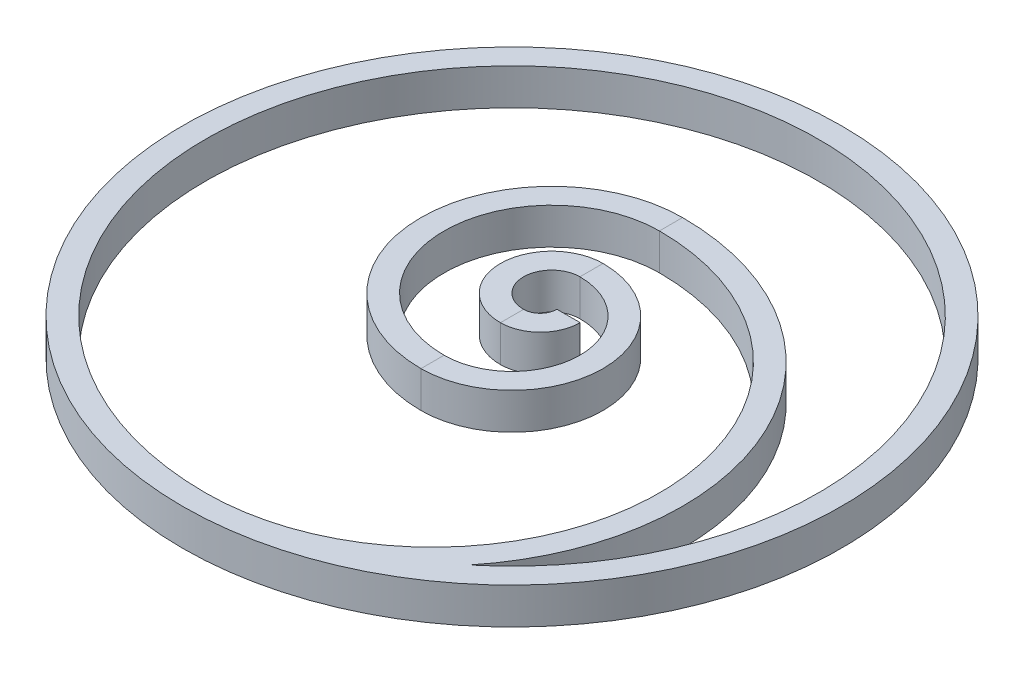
ISO-10303-21;
HEADER;
FILE_DESCRIPTION(('STEP AP214'),'2;1');
FILE_NAME('part.step','',(''),(''),'','','');
FILE_SCHEMA(('AUTOMOTIVE_DESIGN { 1 0 10303 214 1 1 1 1 }'));
ENDSEC;
DATA;
#1=APPLICATION_CONTEXT('core data for automotive mechanical design processes');
#2=APPLICATION_PROTOCOL_DEFINITION('international standard','automotive_design',2000,#1);
#3=PRODUCT_CONTEXT('',#1,'mechanical');
#4=PRODUCT('Part','Part','',(#3));
#5=PRODUCT_RELATED_PRODUCT_CATEGORY('part','',(#4));
#6=PRODUCT_DEFINITION_FORMATION('','',#4);
#7=PRODUCT_DEFINITION_CONTEXT('part definition',#1,'design');
#8=PRODUCT_DEFINITION('design','',#6,#7);
#9=PRODUCT_DEFINITION_SHAPE('','',#8);
#10=(LENGTH_UNIT() NAMED_UNIT(*) SI_UNIT(.MILLI.,.METRE.));
#11=(NAMED_UNIT(*) PLANE_ANGLE_UNIT() SI_UNIT($,.RADIAN.));
#12=(NAMED_UNIT(*) SI_UNIT($,.STERADIAN.) SOLID_ANGLE_UNIT());
#13=UNCERTAINTY_MEASURE_WITH_UNIT(LENGTH_MEASURE(1.E-05),#10,'distance_accuracy_value','');
#14=(GEOMETRIC_REPRESENTATION_CONTEXT(3) GLOBAL_UNCERTAINTY_ASSIGNED_CONTEXT((#13)) GLOBAL_UNIT_ASSIGNED_CONTEXT((#10,
#11,#12)) REPRESENTATION_CONTEXT('',''));
#15=CARTESIAN_POINT('',(0.,0.,0.));
#16=DIRECTION('',(0.,0.,1.));
#17=DIRECTION('',(1.,0.,0.));
#18=AXIS2_PLACEMENT_3D('',#15,#16,#17);
#19=CARTESIAN_POINT('',(-30.3271902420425,0.,-3.04623481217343));
#20=DIRECTION('',(0.00405620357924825,0.,0.999991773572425));
#21=DIRECTION('',(0.999991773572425,0.,-0.00405620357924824));
#22=AXIS2_PLACEMENT_3D('',#19,#20,#21);
#23=PLANE('',#22);
#24=DIRECTION('',(0.,1.,0.));
#25=VECTOR('',#24,1.);
#26=CARTESIAN_POINT('',(3.39980503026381,-2.00000000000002,-3.18303949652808));
#27=LINE('',#26,#25);
#28=CARTESIAN_POINT('',(3.39980503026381,-2.00000000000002,-3.18303949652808));
#29=VERTEX_POINT('',#28);
#30=CARTESIAN_POINT('',(3.39980503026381,1.99999999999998,-3.18303949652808));
#31=VERTEX_POINT('',#30);
#32=EDGE_CURVE('E259',#29,#31,#27,.T.);
#33=ORIENTED_EDGE('',*,*,#32,.T.);
#34=DIRECTION('',(0.999991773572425,0.,-0.00405620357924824));
#35=VECTOR('',#34,1.);
#36=CARTESIAN_POINT('',(5.9452386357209,1.99999999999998,-3.19336437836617));
#37=LINE('',#36,#35);
#38=CARTESIAN_POINT('',(5.94523863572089,1.99999999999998,-3.19336437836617));
#39=VERTEX_POINT('',#38);
#40=EDGE_CURVE('E246',#31,#39,#37,.T.);
#41=ORIENTED_EDGE('',*,*,#40,.T.);
#42=DIRECTION('',(0.,-1.,0.));
#43=VECTOR('',#42,1.);
#44=CARTESIAN_POINT('',(5.9452386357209,-2.00000000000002,-3.19336437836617));
#45=LINE('',#44,#43);
#46=CARTESIAN_POINT('',(5.94523863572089,-2.00000000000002,-3.19336437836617));
#47=VERTEX_POINT('',#46);
#48=EDGE_CURVE('E245',#39,#47,#45,.T.);
#49=ORIENTED_EDGE('',*,*,#48,.T.);
#50=DIRECTION('',(-0.999991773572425,0.,0.00405620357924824));
#51=VECTOR('',#50,1.);
#52=CARTESIAN_POINT('',(5.9452386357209,-2.00000000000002,-3.19336437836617));
#53=LINE('',#52,#51);
#54=EDGE_CURVE('E11',#47,#29,#53,.T.);
#55=ORIENTED_EDGE('',*,*,#54,.T.);
#56=EDGE_LOOP('',(#33,#41,#49,#55));
#57=FACE_BOUND('',#56,.T.);
#58=ADVANCED_FACE('F38',(#57),#23,.F.);
#59=CARTESIAN_POINT('',(1.56508992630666,0.,8.6818600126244));
#60=DIRECTION('',(0.,1.,0.));
#61=DIRECTION('',(0.,0.,1.));
#62=AXIS2_PLACEMENT_3D('',#59,#60,#61);
#63=CYLINDRICAL_SURFACE('',#62,24.9772727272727);
#64=CARTESIAN_POINT('',(1.56508992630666,1.99999999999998,8.6818600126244));
#65=DIRECTION('',(0.,1.,0.));
#66=DIRECTION('',(0.,0.,1.));
#67=AXIS2_PLACEMENT_3D('',#64,#65,#66);
#68=CIRCLE('',#67,24.9772727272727);
#69=CARTESIAN_POINT('',(1.56508992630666,1.99999999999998,33.6591327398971));
#70=VERTEX_POINT('',#69);
#71=CARTESIAN_POINT('',(1.56508992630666,1.99999999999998,-16.2954127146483));
#72=VERTEX_POINT('',#71);
#73=EDGE_CURVE('E169',#70,#72,#68,.T.);
#74=ORIENTED_EDGE('',*,*,#73,.T.);
#75=DIRECTION('',(0.,1.,0.));
#76=VECTOR('',#75,1.);
#77=CARTESIAN_POINT('',(1.56508992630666,-2.00000000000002,-16.2954127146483));
#78=LINE('',#77,#76);
#79=CARTESIAN_POINT('',(1.56508992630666,-2.00000000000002,-16.2954127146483));
#80=VERTEX_POINT('',#79);
#81=EDGE_CURVE('E172',#80,#72,#78,.T.);
#82=ORIENTED_EDGE('',*,*,#81,.F.);
#83=CARTESIAN_POINT('',(1.56508992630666,-2.00000000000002,8.6818600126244));
#84=DIRECTION('',(0.,1.,0.));
#85=DIRECTION('',(0.,0.,1.));
#86=AXIS2_PLACEMENT_3D('',#83,#84,#85);
#87=CIRCLE('',#86,24.9772727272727);
#88=CARTESIAN_POINT('',(1.56508992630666,-2.00000000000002,33.6591327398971));
#89=VERTEX_POINT('',#88);
#90=EDGE_CURVE('E295',#89,#80,#87,.T.);
#91=ORIENTED_EDGE('',*,*,#90,.F.);
#92=DIRECTION('',(0.,1.,0.));
#93=VECTOR('',#92,1.);
#94=CARTESIAN_POINT('',(1.56508992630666,-2.00000000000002,33.6591327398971));
#95=LINE('',#94,#93);
#96=EDGE_CURVE('E178',#89,#70,#95,.T.);
#97=ORIENTED_EDGE('',*,*,#96,.T.);
#98=EDGE_LOOP('',(#74,#82,#91,#97));
#99=FACE_BOUND('',#98,.T.);
#100=ADVANCED_FACE('F317',(#99),#63,.F.);
#101=CARTESIAN_POINT('',(1.56508992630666,1.99999999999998,36.2045872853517));
#102=DIRECTION('',(0.,1.,0.));
#103=DIRECTION('',(0.,0.,1.));
#104=AXIS2_PLACEMENT_3D('',#101,#102,#103);
#105=PLANE('',#104);
#106=CARTESIAN_POINT('',(1.56508992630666,1.99999999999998,-0.0681399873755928));
#107=DIRECTION('',(0.,1.,0.));
#108=DIRECTION('',(0.,0.,1.));
#109=AXIS2_PLACEMENT_3D('',#106,#107,#108);
#110=CIRCLE('',#109,36.2727272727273);
#111=CARTESIAN_POINT('',(1.56508992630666,1.99999999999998,36.2045872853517));
#112=VERTEX_POINT('',#111);
#113=EDGE_CURVE('E194',#112,#112,#110,.T.);
#114=ORIENTED_EDGE('',*,*,#113,.T.);
#115=EDGE_LOOP('',(#114));
#116=FACE_BOUND('',#115,.T.);
#117=ORIENTED_EDGE('',*,*,#73,.F.);
#118=CARTESIAN_POINT('',(1.56508992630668,1.99999999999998,-0.0681399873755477));
#119=DIRECTION('',(0.,1.,0.));
#120=DIRECTION('',(0.,0.,1.));
#121=AXIS2_PLACEMENT_3D('',#118,#119,#120);
#122=CIRCLE('',#121,33.7272727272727);
#123=CARTESIAN_POINT('',(22.9378152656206,1.99999999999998,26.0227691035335));
#124=VERTEX_POINT('',#123);
#125=EDGE_CURVE('E140',#124,#70,#122,.T.);
#126=ORIENTED_EDGE('',*,*,#125,.F.);
#127=CARTESIAN_POINT('',(1.56508992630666,1.99999999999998,8.68186001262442));
#128=DIRECTION('',(0.,1.,0.));
#129=DIRECTION('',(0.,0.,1.));
#130=AXIS2_PLACEMENT_3D('',#127,#128,#129);
#131=CIRCLE('',#130,27.5227272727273);
#132=CARTESIAN_POINT('',(1.56508992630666,1.99999999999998,-18.8408672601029));
#133=VERTEX_POINT('',#132);
#134=EDGE_CURVE('E132',#124,#133,#131,.T.);
#135=ORIENTED_EDGE('',*,*,#134,.T.);
#136=DIRECTION('',(0.,0.,-1.));
#137=VECTOR('',#136,1.);
#138=CARTESIAN_POINT('',(1.56508992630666,1.99999999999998,-18.8408672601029));
#139=LINE('',#138,#137);
#140=EDGE_CURVE('E137',#72,#133,#139,.T.);
#141=ORIENTED_EDGE('',*,*,#140,.F.);
#142=EDGE_LOOP('',(#117,#126,#135,#141));
#143=FACE_BOUND('',#142,.T.);
#144=ADVANCED_FACE('F135',(#116,#143),#105,.T.);
#145=CARTESIAN_POINT('',(1.56508992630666,0.,8.68186001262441));
#146=DIRECTION('',(0.,1.,0.));
#147=DIRECTION('',(0.,0.,1.));
#148=AXIS2_PLACEMENT_3D('',#145,#146,#147);
#149=CYLINDRICAL_SURFACE('',#148,27.5227272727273);
#150=DIRECTION('',(0.,1.,0.));
#151=VECTOR('',#150,1.);
#152=CARTESIAN_POINT('',(22.9378152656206,0.,26.0227691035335));
#153=LINE('',#152,#151);
#154=CARTESIAN_POINT('',(22.9378152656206,-2.00000000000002,26.0227691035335));
#155=VERTEX_POINT('',#154);
#156=EDGE_CURVE('E58',#155,#124,#153,.T.);
#157=ORIENTED_EDGE('',*,*,#156,.F.);
#158=CARTESIAN_POINT('',(1.56508992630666,-2.00000000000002,8.68186001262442));
#159=DIRECTION('',(0.,1.,0.));
#160=DIRECTION('',(0.,0.,1.));
#161=AXIS2_PLACEMENT_3D('',#158,#159,#160);
#162=CIRCLE('',#161,27.5227272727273);
#163=CARTESIAN_POINT('',(1.56508992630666,-2.00000000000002,-18.8408672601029));
#164=VERTEX_POINT('',#163);
#165=EDGE_CURVE('E161',#155,#164,#162,.T.);
#166=ORIENTED_EDGE('',*,*,#165,.T.);
#167=DIRECTION('',(0.,-1.,0.));
#168=VECTOR('',#167,1.);
#169=CARTESIAN_POINT('',(1.56508992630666,-2.00000000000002,-18.8408672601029));
#170=LINE('',#169,#168);
#171=EDGE_CURVE('E143',#133,#164,#170,.T.);
#172=ORIENTED_EDGE('',*,*,#171,.F.);
#173=ORIENTED_EDGE('',*,*,#134,.F.);
#174=EDGE_LOOP('',(#157,#166,#172,#173));
#175=FACE_BOUND('',#174,.T.);
#176=ADVANCED_FACE('F160',(#175),#149,.T.);
#177=CARTESIAN_POINT('',(1.56508992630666,-2.00000000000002,36.2045872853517));
#178=DIRECTION('',(0.,-1.,0.));
#179=DIRECTION('',(0.,0.,-1.));
#180=AXIS2_PLACEMENT_3D('',#177,#178,#179);
#181=PLANE('',#180);
#182=CARTESIAN_POINT('',(1.56508992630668,-2.00000000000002,-0.0681399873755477));
#183=DIRECTION('',(0.,1.,0.));
#184=DIRECTION('',(0.,0.,1.));
#185=AXIS2_PLACEMENT_3D('',#182,#183,#184);
#186=CIRCLE('',#185,33.7272727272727);
#187=EDGE_CURVE('E183',#155,#89,#186,.T.);
#188=ORIENTED_EDGE('',*,*,#187,.T.);
#189=ORIENTED_EDGE('',*,*,#90,.T.);
#190=DIRECTION('',(0.,0.,1.));
#191=VECTOR('',#190,1.);
#192=CARTESIAN_POINT('',(1.56508992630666,-2.00000000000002,-18.8408672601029));
#193=LINE('',#192,#191);
#194=EDGE_CURVE('E181',#164,#80,#193,.T.);
#195=ORIENTED_EDGE('',*,*,#194,.F.);
#196=ORIENTED_EDGE('',*,*,#165,.F.);
#197=EDGE_LOOP('',(#188,#189,#195,#196));
#198=FACE_BOUND('',#197,.T.);
#199=CARTESIAN_POINT('',(1.56508992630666,-2.00000000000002,-0.0681399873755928));
#200=DIRECTION('',(0.,1.,0.));
#201=DIRECTION('',(0.,0.,1.));
#202=AXIS2_PLACEMENT_3D('',#199,#200,#201);
#203=CIRCLE('',#202,36.2727272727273);
#204=CARTESIAN_POINT('',(1.56508992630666,-2.00000000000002,36.2045872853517));
#205=VERTEX_POINT('',#204);
#206=EDGE_CURVE('E179',#205,#205,#203,.T.);
#207=ORIENTED_EDGE('',*,*,#206,.F.);
#208=EDGE_LOOP('',(#207));
#209=FACE_BOUND('',#208,.T.);
#210=ADVANCED_FACE('F309',(#198,#209),#181,.T.);
#211=CARTESIAN_POINT('',(1.56508992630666,0.,-4.44313998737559));
#212=DIRECTION('',(0.,1.,0.));
#213=DIRECTION('',(0.,0.,1.));
#214=AXIS2_PLACEMENT_3D('',#211,#212,#213);
#215=CYLINDRICAL_SURFACE('',#214,11.8522727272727);
#216=CARTESIAN_POINT('',(1.56508992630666,1.99999999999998,-4.44313998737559));
#217=DIRECTION('',(0.,1.,0.));
#218=DIRECTION('',(0.,0.,1.));
#219=AXIS2_PLACEMENT_3D('',#216,#217,#218);
#220=CIRCLE('',#219,11.8522727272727);
#221=CARTESIAN_POINT('',(1.56508992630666,1.99999999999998,7.40913273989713));
#222=VERTEX_POINT('',#221);
#223=EDGE_CURVE('E167',#72,#222,#220,.T.);
#224=ORIENTED_EDGE('',*,*,#223,.T.);
#225=DIRECTION('',(0.,1.,0.));
#226=VECTOR('',#225,1.);
#227=CARTESIAN_POINT('',(1.56508992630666,-2.00000000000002,7.40913273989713));
#228=LINE('',#227,#226);
#229=CARTESIAN_POINT('',(1.56508992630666,-2.00000000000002,7.40913273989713));
#230=VERTEX_POINT('',#229);
#231=EDGE_CURVE('E284',#230,#222,#228,.T.);
#232=ORIENTED_EDGE('',*,*,#231,.F.);
#233=CARTESIAN_POINT('',(1.56508992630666,-2.00000000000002,-4.44313998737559));
#234=DIRECTION('',(0.,1.,0.));
#235=DIRECTION('',(0.,0.,1.));
#236=AXIS2_PLACEMENT_3D('',#233,#234,#235);
#237=CIRCLE('',#236,11.8522727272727);
#238=EDGE_CURVE('E190',#80,#230,#237,.T.);
#239=ORIENTED_EDGE('',*,*,#238,.F.);
#240=ORIENTED_EDGE('',*,*,#81,.T.);
#241=EDGE_LOOP('',(#224,#232,#239,#240));
#242=FACE_BOUND('',#241,.T.);
#243=ADVANCED_FACE('F319',(#242),#215,.F.);
#244=CARTESIAN_POINT('',(1.56508992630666,1.99999999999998,-18.8408672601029));
#245=DIRECTION('',(0.,1.,0.));
#246=DIRECTION('',(0.,0.,1.));
#247=AXIS2_PLACEMENT_3D('',#244,#245,#246);
#248=PLANE('',#247);
#249=CARTESIAN_POINT('',(1.56508992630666,1.99999999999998,-4.44313998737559));
#250=DIRECTION('',(0.,1.,0.));
#251=DIRECTION('',(0.,0.,1.));
#252=AXIS2_PLACEMENT_3D('',#249,#250,#251);
#253=CIRCLE('',#252,14.3977272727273);
#254=CARTESIAN_POINT('',(1.56508992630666,1.99999999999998,9.95458728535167));
#255=VERTEX_POINT('',#254);
#256=EDGE_CURVE('E149',#133,#255,#253,.T.);
#257=ORIENTED_EDGE('',*,*,#256,.T.);
#258=DIRECTION('',(0.,0.,1.));
#259=VECTOR('',#258,1.);
#260=CARTESIAN_POINT('',(1.56508992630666,1.99999999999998,9.95458728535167));
#261=LINE('',#260,#259);
#262=EDGE_CURVE('E158',#222,#255,#261,.T.);
#263=ORIENTED_EDGE('',*,*,#262,.F.);
#264=ORIENTED_EDGE('',*,*,#223,.F.);
#265=ORIENTED_EDGE('',*,*,#140,.T.);
#266=EDGE_LOOP('',(#257,#263,#264,#265));
#267=FACE_BOUND('',#266,.T.);
#268=ADVANCED_FACE('F165',(#267),#248,.T.);
#269=CARTESIAN_POINT('',(1.56508992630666,0.,-4.44313998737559));
#270=DIRECTION('',(0.,1.,0.));
#271=DIRECTION('',(0.,0.,1.));
#272=AXIS2_PLACEMENT_3D('',#269,#270,#271);
#273=CYLINDRICAL_SURFACE('',#272,14.3977272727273);
#274=CARTESIAN_POINT('',(1.56508992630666,-2.00000000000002,-4.44313998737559));
#275=DIRECTION('',(0.,1.,0.));
#276=DIRECTION('',(0.,0.,1.));
#277=AXIS2_PLACEMENT_3D('',#274,#275,#276);
#278=CIRCLE('',#277,14.3977272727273);
#279=CARTESIAN_POINT('',(1.56508992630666,-2.00000000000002,9.95458728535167));
#280=VERTEX_POINT('',#279);
#281=EDGE_CURVE('E195',#164,#280,#278,.T.);
#282=ORIENTED_EDGE('',*,*,#281,.T.);
#283=DIRECTION('',(0.,-1.,0.));
#284=VECTOR('',#283,1.);
#285=CARTESIAN_POINT('',(1.56508992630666,-2.00000000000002,9.95458728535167));
#286=LINE('',#285,#284);
#287=EDGE_CURVE('E153',#255,#280,#286,.T.);
#288=ORIENTED_EDGE('',*,*,#287,.F.);
#289=ORIENTED_EDGE('',*,*,#256,.F.);
#290=ORIENTED_EDGE('',*,*,#171,.T.);
#291=EDGE_LOOP('',(#282,#288,#289,#290));
#292=FACE_BOUND('',#291,.T.);
#293=ADVANCED_FACE('F151',(#292),#273,.T.);
#294=CARTESIAN_POINT('',(1.56508992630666,-2.00000000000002,-18.8408672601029));
#295=DIRECTION('',(0.,-1.,0.));
#296=DIRECTION('',(0.,0.,-1.));
#297=AXIS2_PLACEMENT_3D('',#294,#295,#296);
#298=PLANE('',#297);
#299=DIRECTION('',(0.,0.,-1.));
#300=VECTOR('',#299,1.);
#301=CARTESIAN_POINT('',(1.56508992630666,-2.00000000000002,9.95458728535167));
#302=LINE('',#301,#300);
#303=EDGE_CURVE('E198',#280,#230,#302,.T.);
#304=ORIENTED_EDGE('',*,*,#303,.F.);
#305=ORIENTED_EDGE('',*,*,#281,.F.);
#306=ORIENTED_EDGE('',*,*,#194,.T.);
#307=ORIENTED_EDGE('',*,*,#238,.T.);
#308=EDGE_LOOP('',(#304,#305,#306,#307));
#309=FACE_BOUND('',#308,.T.);
#310=ADVANCED_FACE('F315',(#309),#298,.T.);
#311=CARTESIAN_POINT('',(1.56508992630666,0.,-0.0681399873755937));
#312=DIRECTION('',(0.,1.,0.));
#313=DIRECTION('',(0.,0.,1.));
#314=AXIS2_PLACEMENT_3D('',#311,#312,#313);
#315=CYLINDRICAL_SURFACE('',#314,7.47727272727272);
#316=CARTESIAN_POINT('',(1.56508992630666,1.99999999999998,-0.0681399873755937));
#317=DIRECTION('',(0.,1.,0.));
#318=DIRECTION('',(0.,0.,1.));
#319=AXIS2_PLACEMENT_3D('',#316,#317,#318);
#320=CIRCLE('',#319,7.47727272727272);
#321=CARTESIAN_POINT('',(1.56508992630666,1.99999999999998,-7.54541271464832));
#322=VERTEX_POINT('',#321);
#323=EDGE_CURVE('E212',#222,#322,#320,.T.);
#324=ORIENTED_EDGE('',*,*,#323,.T.);
#325=DIRECTION('',(0.,1.,0.));
#326=VECTOR('',#325,1.);
#327=CARTESIAN_POINT('',(1.56508992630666,-2.00000000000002,-7.54541271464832));
#328=LINE('',#327,#326);
#329=CARTESIAN_POINT('',(1.56508992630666,-2.00000000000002,-7.54541271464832));
#330=VERTEX_POINT('',#329);
#331=EDGE_CURVE('E274',#330,#322,#328,.T.);
#332=ORIENTED_EDGE('',*,*,#331,.F.);
#333=CARTESIAN_POINT('',(1.56508992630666,-2.00000000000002,-0.0681399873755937));
#334=DIRECTION('',(0.,1.,0.));
#335=DIRECTION('',(0.,0.,1.));
#336=AXIS2_PLACEMENT_3D('',#333,#334,#335);
#337=CIRCLE('',#336,7.47727272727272);
#338=EDGE_CURVE('E224',#230,#330,#337,.T.);
#339=ORIENTED_EDGE('',*,*,#338,.F.);
#340=ORIENTED_EDGE('',*,*,#231,.T.);
#341=EDGE_LOOP('',(#324,#332,#339,#340));
#342=FACE_BOUND('',#341,.T.);
#343=ADVANCED_FACE('F322',(#342),#315,.F.);
#344=CARTESIAN_POINT('',(1.56508992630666,1.99999999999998,9.95458728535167));
#345=DIRECTION('',(0.,1.,0.));
#346=DIRECTION('',(0.,0.,1.));
#347=AXIS2_PLACEMENT_3D('',#344,#345,#346);
#348=PLANE('',#347);
#349=CARTESIAN_POINT('',(1.56508992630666,1.99999999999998,-0.0681399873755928));
#350=DIRECTION('',(0.,1.,0.));
#351=DIRECTION('',(0.,0.,1.));
#352=AXIS2_PLACEMENT_3D('',#349,#350,#351);
#353=CIRCLE('',#352,10.0227272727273);
#354=CARTESIAN_POINT('',(1.56508992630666,1.99999999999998,-10.0908672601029));
#355=VERTEX_POINT('',#354);
#356=EDGE_CURVE('E203',#255,#355,#353,.T.);
#357=ORIENTED_EDGE('',*,*,#356,.T.);
#358=DIRECTION('',(0.,0.,-1.));
#359=VECTOR('',#358,1.);
#360=CARTESIAN_POINT('',(1.56508992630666,1.99999999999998,-10.0908672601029));
#361=LINE('',#360,#359);
#362=EDGE_CURVE('E208',#322,#355,#361,.T.);
#363=ORIENTED_EDGE('',*,*,#362,.F.);
#364=ORIENTED_EDGE('',*,*,#323,.F.);
#365=ORIENTED_EDGE('',*,*,#262,.T.);
#366=EDGE_LOOP('',(#357,#363,#364,#365));
#367=FACE_BOUND('',#366,.T.);
#368=ADVANCED_FACE('F332',(#367),#348,.T.);
#369=CARTESIAN_POINT('',(1.56508992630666,0.,-0.0681399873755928));
#370=DIRECTION('',(0.,1.,0.));
#371=DIRECTION('',(0.,0.,1.));
#372=AXIS2_PLACEMENT_3D('',#369,#370,#371);
#373=CYLINDRICAL_SURFACE('',#372,10.0227272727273);
#374=CARTESIAN_POINT('',(1.56508992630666,-2.00000000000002,-0.0681399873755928));
#375=DIRECTION('',(0.,1.,0.));
#376=DIRECTION('',(0.,0.,1.));
#377=AXIS2_PLACEMENT_3D('',#374,#375,#376);
#378=CIRCLE('',#377,10.0227272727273);
#379=CARTESIAN_POINT('',(1.56508992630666,-2.00000000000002,-10.0908672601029));
#380=VERTEX_POINT('',#379);
#381=EDGE_CURVE('E213',#280,#380,#378,.T.);
#382=ORIENTED_EDGE('',*,*,#381,.T.);
#383=DIRECTION('',(0.,-1.,0.));
#384=VECTOR('',#383,1.);
#385=CARTESIAN_POINT('',(1.56508992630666,-2.00000000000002,-10.0908672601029));
#386=LINE('',#385,#384);
#387=EDGE_CURVE('E207',#355,#380,#386,.T.);
#388=ORIENTED_EDGE('',*,*,#387,.F.);
#389=ORIENTED_EDGE('',*,*,#356,.F.);
#390=ORIENTED_EDGE('',*,*,#287,.T.);
#391=EDGE_LOOP('',(#382,#388,#389,#390));
#392=FACE_BOUND('',#391,.T.);
#393=ADVANCED_FACE('F328',(#392),#373,.T.);
#394=CARTESIAN_POINT('',(1.56508992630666,-2.00000000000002,9.95458728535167));
#395=DIRECTION('',(0.,-1.,0.));
#396=DIRECTION('',(0.,0.,-1.));
#397=AXIS2_PLACEMENT_3D('',#394,#395,#396);
#398=PLANE('',#397);
#399=DIRECTION('',(0.,0.,1.));
#400=VECTOR('',#399,1.);
#401=CARTESIAN_POINT('',(1.56508992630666,-2.00000000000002,-10.0908672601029));
#402=LINE('',#401,#400);
#403=EDGE_CURVE('E217',#380,#330,#402,.T.);
#404=ORIENTED_EDGE('',*,*,#403,.F.);
#405=ORIENTED_EDGE('',*,*,#381,.F.);
#406=ORIENTED_EDGE('',*,*,#303,.T.);
#407=ORIENTED_EDGE('',*,*,#338,.T.);
#408=EDGE_LOOP('',(#404,#405,#406,#407));
#409=FACE_BOUND('',#408,.T.);
#410=ADVANCED_FACE('F326',(#409),#398,.T.);
#411=CARTESIAN_POINT('',(1.56508992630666,0.,-4.44313998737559));
#412=DIRECTION('',(0.,1.,0.));
#413=DIRECTION('',(0.,0.,1.));
#414=AXIS2_PLACEMENT_3D('',#411,#412,#413);
#415=CYLINDRICAL_SURFACE('',#414,3.10227272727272);
#416=CARTESIAN_POINT('',(1.56508992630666,1.99999999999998,-4.44313998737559));
#417=DIRECTION('',(0.,1.,0.));
#418=DIRECTION('',(0.,0.,1.));
#419=AXIS2_PLACEMENT_3D('',#416,#417,#418);
#420=CIRCLE('',#419,3.10227272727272);
#421=CARTESIAN_POINT('',(1.56508992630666,1.99999999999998,-1.34086726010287));
#422=VERTEX_POINT('',#421);
#423=EDGE_CURVE('E243',#322,#422,#420,.T.);
#424=ORIENTED_EDGE('',*,*,#423,.T.);
#425=DIRECTION('',(0.,1.,0.));
#426=VECTOR('',#425,1.);
#427=CARTESIAN_POINT('',(1.56508992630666,-2.00000000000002,-1.34086726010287));
#428=LINE('',#427,#426);
#429=CARTESIAN_POINT('',(1.56508992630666,-2.00000000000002,-1.34086726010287));
#430=VERTEX_POINT('',#429);
#431=EDGE_CURVE('E264',#430,#422,#428,.T.);
#432=ORIENTED_EDGE('',*,*,#431,.F.);
#433=CARTESIAN_POINT('',(1.56508992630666,-2.00000000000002,-4.44313998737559));
#434=DIRECTION('',(0.,1.,0.));
#435=DIRECTION('',(0.,0.,1.));
#436=AXIS2_PLACEMENT_3D('',#433,#434,#435);
#437=CIRCLE('',#436,3.10227272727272);
#438=EDGE_CURVE('E228',#330,#430,#437,.T.);
#439=ORIENTED_EDGE('',*,*,#438,.F.);
#440=ORIENTED_EDGE('',*,*,#331,.T.);
#441=EDGE_LOOP('',(#424,#432,#439,#440));
#442=FACE_BOUND('',#441,.T.);
#443=ADVANCED_FACE('F337',(#442),#415,.F.);
#444=CARTESIAN_POINT('',(1.56508992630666,1.99999999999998,-10.0908672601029));
#445=DIRECTION('',(0.,1.,0.));
#446=DIRECTION('',(0.,0.,1.));
#447=AXIS2_PLACEMENT_3D('',#444,#445,#446);
#448=PLANE('',#447);
#449=CARTESIAN_POINT('',(1.56508992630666,1.99999999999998,-4.44313998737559));
#450=DIRECTION('',(0.,1.,0.));
#451=DIRECTION('',(0.,0.,1.));
#452=AXIS2_PLACEMENT_3D('',#449,#450,#451);
#453=CIRCLE('',#452,5.64772727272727);
#454=CARTESIAN_POINT('',(1.56508992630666,1.99999999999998,1.20458728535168));
#455=VERTEX_POINT('',#454);
#456=EDGE_CURVE('E236',#355,#455,#453,.T.);
#457=ORIENTED_EDGE('',*,*,#456,.T.);
#458=DIRECTION('',(0.,0.,1.));
#459=VECTOR('',#458,1.);
#460=CARTESIAN_POINT('',(1.56508992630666,1.99999999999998,1.20458728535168));
#461=LINE('',#460,#459);
#462=EDGE_CURVE('E240',#422,#455,#461,.T.);
#463=ORIENTED_EDGE('',*,*,#462,.F.);
#464=ORIENTED_EDGE('',*,*,#423,.F.);
#465=ORIENTED_EDGE('',*,*,#362,.T.);
#466=EDGE_LOOP('',(#457,#463,#464,#465));
#467=FACE_BOUND('',#466,.T.);
#468=ADVANCED_FACE('F334',(#467),#448,.T.);
#469=CARTESIAN_POINT('',(1.56508992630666,0.,-4.44313998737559));
#470=DIRECTION('',(0.,1.,0.));
#471=DIRECTION('',(0.,0.,1.));
#472=AXIS2_PLACEMENT_3D('',#469,#470,#471);
#473=CYLINDRICAL_SURFACE('',#472,5.64772727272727);
#474=CARTESIAN_POINT('',(1.56508992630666,-2.00000000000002,-4.44313998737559));
#475=DIRECTION('',(0.,1.,0.));
#476=DIRECTION('',(0.,0.,1.));
#477=AXIS2_PLACEMENT_3D('',#474,#475,#476);
#478=CIRCLE('',#477,5.64772727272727);
#479=CARTESIAN_POINT('',(1.56508992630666,-2.00000000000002,1.20458728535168));
#480=VERTEX_POINT('',#479);
#481=EDGE_CURVE('E229',#380,#480,#478,.T.);
#482=ORIENTED_EDGE('',*,*,#481,.T.);
#483=DIRECTION('',(0.,-1.,0.));
#484=VECTOR('',#483,1.);
#485=CARTESIAN_POINT('',(1.56508992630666,-2.00000000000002,1.20458728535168));
#486=LINE('',#485,#484);
#487=EDGE_CURVE('E233',#455,#480,#486,.T.);
#488=ORIENTED_EDGE('',*,*,#487,.F.);
#489=ORIENTED_EDGE('',*,*,#456,.F.);
#490=ORIENTED_EDGE('',*,*,#387,.T.);
#491=EDGE_LOOP('',(#482,#488,#489,#490));
#492=FACE_BOUND('',#491,.T.);
#493=ADVANCED_FACE('F408',(#492),#473,.T.);
#494=CARTESIAN_POINT('',(1.56508992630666,-2.00000000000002,-10.0908672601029));
#495=DIRECTION('',(0.,-1.,0.));
#496=DIRECTION('',(0.,0.,-1.));
#497=AXIS2_PLACEMENT_3D('',#494,#495,#496);
#498=PLANE('',#497);
#499=DIRECTION('',(0.,0.,-1.));
#500=VECTOR('',#499,1.);
#501=CARTESIAN_POINT('',(1.56508992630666,-2.00000000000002,1.20458728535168));
#502=LINE('',#501,#500);
#503=EDGE_CURVE('E42',#480,#430,#502,.T.);
#504=ORIENTED_EDGE('',*,*,#503,.F.);
#505=ORIENTED_EDGE('',*,*,#481,.F.);
#506=ORIENTED_EDGE('',*,*,#403,.T.);
#507=ORIENTED_EDGE('',*,*,#438,.T.);
#508=EDGE_LOOP('',(#504,#505,#506,#507));
#509=FACE_BOUND('',#508,.T.);
#510=ADVANCED_FACE('F361',(#509),#498,.T.);
#511=CARTESIAN_POINT('',(1.56508992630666,0.,-3.17559745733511));
#512=DIRECTION('',(0.,1.,0.));
#513=DIRECTION('',(0.,0.,1.));
#514=AXIS2_PLACEMENT_3D('',#511,#512,#513);
#515=CYLINDRICAL_SURFACE('',#514,1.83473019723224);
#516=CARTESIAN_POINT('',(1.56508992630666,1.99999999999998,-3.17559745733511));
#517=DIRECTION('',(0.,1.,0.));
#518=DIRECTION('',(0.,0.,1.));
#519=AXIS2_PLACEMENT_3D('',#516,#517,#518);
#520=CIRCLE('',#519,1.83473019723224);
#521=EDGE_CURVE('E103',#422,#31,#520,.T.);
#522=ORIENTED_EDGE('',*,*,#521,.T.);
#523=ORIENTED_EDGE('',*,*,#32,.F.);
#524=CARTESIAN_POINT('',(1.56508992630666,-2.00000000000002,-3.17559745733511));
#525=DIRECTION('',(0.,1.,0.));
#526=DIRECTION('',(0.,0.,1.));
#527=AXIS2_PLACEMENT_3D('',#524,#525,#526);
#528=CIRCLE('',#527,1.83473019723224);
#529=EDGE_CURVE('E260',#430,#29,#528,.T.);
#530=ORIENTED_EDGE('',*,*,#529,.F.);
#531=ORIENTED_EDGE('',*,*,#431,.T.);
#532=EDGE_LOOP('',(#522,#523,#530,#531));
#533=FACE_BOUND('',#532,.T.);
#534=ADVANCED_FACE('F339',(#533),#515,.F.);
#535=CARTESIAN_POINT('',(1.56508992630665,1.99999999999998,1.20458728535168));
#536=DIRECTION('',(0.,1.,0.));
#537=DIRECTION('',(0.,0.,1.));
#538=AXIS2_PLACEMENT_3D('',#535,#536,#537);
#539=PLANE('',#538);
#540=CARTESIAN_POINT('',(1.56508992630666,1.99999999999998,-3.17559745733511));
#541=DIRECTION('',(0.,1.,0.));
#542=DIRECTION('',(0.,0.,1.));
#543=AXIS2_PLACEMENT_3D('',#540,#541,#542);
#544=CIRCLE('',#543,4.38018474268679);
#545=EDGE_CURVE('E93',#455,#39,#544,.T.);
#546=ORIENTED_EDGE('',*,*,#545,.T.);
#547=ORIENTED_EDGE('',*,*,#40,.F.);
#548=ORIENTED_EDGE('',*,*,#521,.F.);
#549=ORIENTED_EDGE('',*,*,#462,.T.);
#550=EDGE_LOOP('',(#546,#547,#548,#549));
#551=FACE_BOUND('',#550,.T.);
#552=ADVANCED_FACE('F353',(#551),#539,.T.);
#553=CARTESIAN_POINT('',(1.56508992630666,0.,-3.17559745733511));
#554=DIRECTION('',(0.,1.,0.));
#555=DIRECTION('',(0.,0.,1.));
#556=AXIS2_PLACEMENT_3D('',#553,#554,#555);
#557=CYLINDRICAL_SURFACE('',#556,4.38018474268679);
#558=CARTESIAN_POINT('',(1.56508992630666,-2.00000000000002,-3.17559745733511));
#559=DIRECTION('',(0.,1.,0.));
#560=DIRECTION('',(0.,0.,1.));
#561=AXIS2_PLACEMENT_3D('',#558,#559,#560);
#562=CIRCLE('',#561,4.38018474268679);
#563=EDGE_CURVE('E49',#480,#47,#562,.T.);
#564=ORIENTED_EDGE('',*,*,#563,.T.);
#565=ORIENTED_EDGE('',*,*,#48,.F.);
#566=ORIENTED_EDGE('',*,*,#545,.F.);
#567=ORIENTED_EDGE('',*,*,#487,.T.);
#568=EDGE_LOOP('',(#564,#565,#566,#567));
#569=FACE_BOUND('',#568,.T.);
#570=ADVANCED_FACE('F352',(#569),#557,.T.);
#571=CARTESIAN_POINT('',(1.56508992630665,-2.00000000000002,1.20458728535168));
#572=DIRECTION('',(0.,-1.,0.));
#573=DIRECTION('',(0.,0.,-1.));
#574=AXIS2_PLACEMENT_3D('',#571,#572,#573);
#575=PLANE('',#574);
#576=ORIENTED_EDGE('',*,*,#54,.F.);
#577=ORIENTED_EDGE('',*,*,#563,.F.);
#578=ORIENTED_EDGE('',*,*,#503,.T.);
#579=ORIENTED_EDGE('',*,*,#529,.T.);
#580=EDGE_LOOP('',(#576,#577,#578,#579));
#581=FACE_BOUND('',#580,.T.);
#582=ADVANCED_FACE('F346',(#581),#575,.T.);
#583=CARTESIAN_POINT('',(1.56508992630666,0.,-0.0681399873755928));
#584=DIRECTION('',(0.,1.,0.));
#585=DIRECTION('',(0.,0.,1.));
#586=AXIS2_PLACEMENT_3D('',#583,#584,#585);
#587=CYLINDRICAL_SURFACE('',#586,36.2727272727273);
#588=ORIENTED_EDGE('',*,*,#206,.T.);
#589=EDGE_LOOP('',(#588));
#590=FACE_BOUND('',#589,.T.);
#591=ORIENTED_EDGE('',*,*,#113,.F.);
#592=EDGE_LOOP('',(#591));
#593=FACE_BOUND('',#592,.T.);
#594=ADVANCED_FACE('F364',(#590,#593),#587,.T.);
#595=CARTESIAN_POINT('',(1.56508992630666,0.,-0.0681399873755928));
#596=DIRECTION('',(0.,1.,0.));
#597=DIRECTION('',(0.,0.,1.));
#598=AXIS2_PLACEMENT_3D('',#595,#596,#597);
#599=CYLINDRICAL_SURFACE('',#598,33.7272727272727);
#600=ORIENTED_EDGE('',*,*,#187,.F.);
#601=ORIENTED_EDGE('',*,*,#156,.T.);
#602=ORIENTED_EDGE('',*,*,#125,.T.);
#603=ORIENTED_EDGE('',*,*,#96,.F.);
#604=EDGE_LOOP('',(#600,#601,#602,#603));
#605=FACE_BOUND('',#604,.T.);
#606=ADVANCED_FACE('F40',(#605),#599,.F.);
#607=CLOSED_SHELL('',(#58,#100,#144,#176,#210,#243,#268,#293,#310,#343,#368,#393,#410,#443,#468,
#493,#510,#534,#552,#570,#582,#594,#606));
#608=MANIFOLD_SOLID_BREP('B2',#607);
#609=ADVANCED_BREP_SHAPE_REPRESENTATION('',(#18,#608),#14);
#610=SHAPE_DEFINITION_REPRESENTATION(#9,#609);
ENDSEC;
END-ISO-10303-21;
